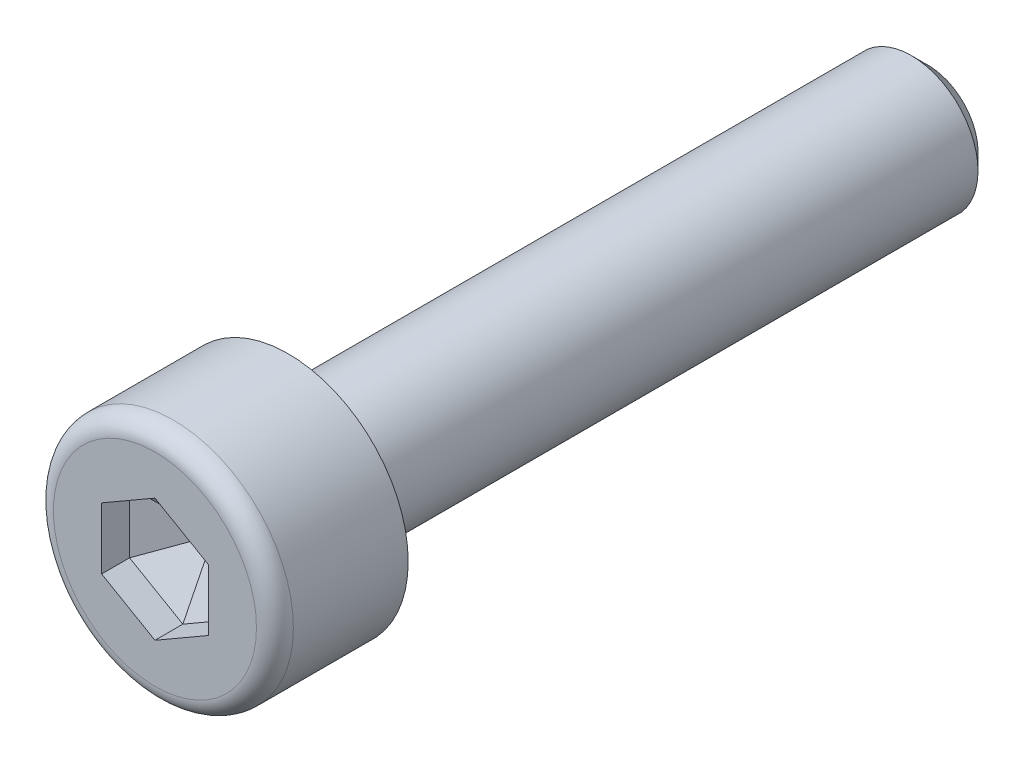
from build123d import *
from OCP.BRepFilletAPI import BRepFilletAPI_MakeChamfer

# Parameters (mm, degrees)
SKETCH_1_R          = 2.25
EXTRUDE_1_DEPTH     = 2.5
CUT_EXTRUDE_1_DEPTH = 1.1
SKETCH_3_R          = 1.25
EXTRUDE_2_DEPTH     = 12
CHAMFER_1_SIZE      = 0.3125
FILLET_1_R          = 0.346153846
CHAMFER_2_SIZE      = 0.576368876
CHAMFER_2_SIZE2     = 0.998300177
FILLET_2_R          = 0.1


with BuildPart() as part:
    # Sketch 1 → Extrude 1 (new body)
    with BuildSketch(Plane.XY):
        Circle(SKETCH_1_R)
    extrude(amount=EXTRUDE_1_DEPTH)

    # Sketch 2 → Cut-Extrude 1 (cut)
    with BuildSketch(Plane.XY.offset(2.5)):
        Polygon((1, 0.577350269), (0, 1.154700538), (-1, 0.577350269), (-1, -0.577350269), (0, -1.154700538), (1, -0.577350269), align=None)
    extrude(amount=-CUT_EXTRUDE_1_DEPTH, mode=Mode.SUBTRACT)

    # Sketch 3 → Extrude 2 (add)
    with BuildSketch(Plane(origin=(0, 0, 0), x_dir=(-1, 0, 0), z_dir=(0, 0, -1))):
        with Locations(Location((0, 0, 0), (0, 0, 180))):
            Circle(SKETCH_3_R)
    extrude(amount=EXTRUDE_2_DEPTH)

    # Chamfer 1
    chamfer_1_edges = [part.edges().sort_by_distance(p)[0] for p in [
        (-1.25, 0, -12),
    ]]
    chamfer(chamfer_1_edges, length=CHAMFER_1_SIZE)

    # Fillet 1
    fillet_1_edges = [part.edges().sort_by_distance(p)[0] for p in [
        (-2.25, 0, 2.5),
    ]]
    fillet(fillet_1_edges, radius=FILLET_1_R)

    # Chamfer 2: one chamfer whose edges measure the first distance from different faces: ONE call of the kernel's chamfer builder (chamfer() names one face for all edges)
    chamfer_2_edges_1 = [part.edges().sort_by_distance(p)[0] for p in [
        (-0.5, 0.866025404, 1.4),
    ]]
    chamfer_2_side_1 = [part.faces().sort_by_distance(p)[0] for p in [
        (-0.5, 0.866025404, 1.95),
    ]]
    chamfer_2_edges_2 = [part.edges().sort_by_distance(p)[0] for p in [
        (0.5, 0.866025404, 1.4),
    ]]
    chamfer_2_side_2 = [part.faces().sort_by_distance(p)[0] for p in [
        (0.5, 0.866025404, 1.95),
    ]]
    chamfer_2_edges_3 = [part.edges().sort_by_distance(p)[0] for p in [
        (1, 0, 1.4),
    ]]
    chamfer_2_side_3 = [part.faces().sort_by_distance(p)[0] for p in [
        (1, 0, 1.95),
    ]]
    chamfer_2_edges_4 = [part.edges().sort_by_distance(p)[0] for p in [
        (0.5, -0.866025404, 1.4),
    ]]
    chamfer_2_side_4 = [part.faces().sort_by_distance(p)[0] for p in [
        (0.5, -0.866025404, 1.95),
    ]]
    chamfer_2_edges_5 = [part.edges().sort_by_distance(p)[0] for p in [
        (-0.5, -0.866025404, 1.4),
    ]]
    chamfer_2_side_5 = [part.faces().sort_by_distance(p)[0] for p in [
        (-0.5, -0.866025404, 1.95),
    ]]
    chamfer_2_edges_6 = [part.edges().sort_by_distance(p)[0] for p in [
        (-1, 0, 1.4),
    ]]
    chamfer_2_side_6 = [part.faces().sort_by_distance(p)[0] for p in [
        (-1, 0, 1.95),
    ]]
    chamfer_2 = BRepFilletAPI_MakeChamfer(part.part.solid().wrapped)
    for e in chamfer_2_edges_1:
        chamfer_2.Add(CHAMFER_2_SIZE, CHAMFER_2_SIZE2, e.wrapped, chamfer_2_side_1[0].wrapped)  # the first distance lies on this face
    for e in chamfer_2_edges_2:
        chamfer_2.Add(CHAMFER_2_SIZE, CHAMFER_2_SIZE2, e.wrapped, chamfer_2_side_2[0].wrapped)  # the first distance lies on this face
    for e in chamfer_2_edges_3:
        chamfer_2.Add(CHAMFER_2_SIZE, CHAMFER_2_SIZE2, e.wrapped, chamfer_2_side_3[0].wrapped)  # the first distance lies on this face
    for e in chamfer_2_edges_4:
        chamfer_2.Add(CHAMFER_2_SIZE, CHAMFER_2_SIZE2, e.wrapped, chamfer_2_side_4[0].wrapped)  # the first distance lies on this face
    for e in chamfer_2_edges_5:
        chamfer_2.Add(CHAMFER_2_SIZE, CHAMFER_2_SIZE2, e.wrapped, chamfer_2_side_5[0].wrapped)  # the first distance lies on this face
    for e in chamfer_2_edges_6:
        chamfer_2.Add(CHAMFER_2_SIZE, CHAMFER_2_SIZE2, e.wrapped, chamfer_2_side_6[0].wrapped)  # the first distance lies on this face
    add(Compound.cast(chamfer_2.Shape()), mode=Mode.REPLACE)

    # Fillet 2
    fillet_2_edges = [part.edges().sort_by_distance(p)[0] for p in [
        (-1.25, 0, 0),
    ]]
    fillet(fillet_2_edges, radius=FILLET_2_R)


solid = part.part
